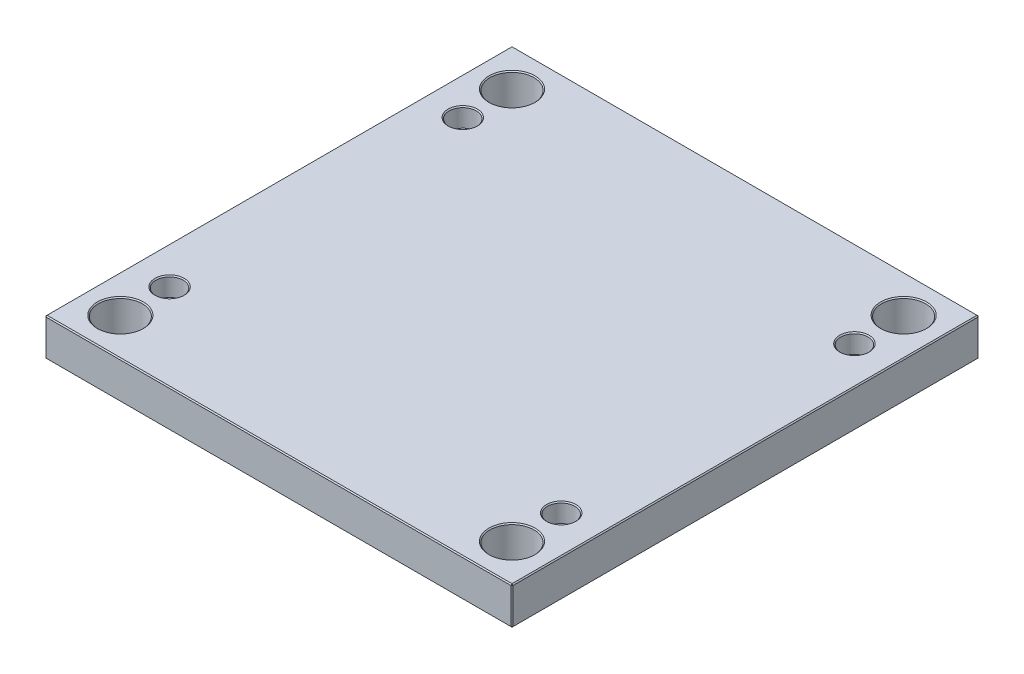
ISO-10303-21;
HEADER;
FILE_DESCRIPTION(('STEP AP214'),'2;1');
FILE_NAME('part.step','',(''),(''),'','','');
FILE_SCHEMA(('AUTOMOTIVE_DESIGN { 1 0 10303 214 1 1 1 1 }'));
ENDSEC;
DATA;
#1=APPLICATION_CONTEXT('core data for automotive mechanical design processes');
#2=APPLICATION_PROTOCOL_DEFINITION('international standard','automotive_design',2000,#1);
#3=PRODUCT_CONTEXT('',#1,'mechanical');
#4=PRODUCT('Part','Part','',(#3));
#5=PRODUCT_RELATED_PRODUCT_CATEGORY('part','',(#4));
#6=PRODUCT_DEFINITION_FORMATION('','',#4);
#7=PRODUCT_DEFINITION_CONTEXT('part definition',#1,'design');
#8=PRODUCT_DEFINITION('design','',#6,#7);
#9=PRODUCT_DEFINITION_SHAPE('','',#8);
#10=(LENGTH_UNIT() NAMED_UNIT(*) SI_UNIT(.MILLI.,.METRE.));
#11=(NAMED_UNIT(*) PLANE_ANGLE_UNIT() SI_UNIT($,.RADIAN.));
#12=(NAMED_UNIT(*) SI_UNIT($,.STERADIAN.) SOLID_ANGLE_UNIT());
#13=UNCERTAINTY_MEASURE_WITH_UNIT(LENGTH_MEASURE(1.E-05),#10,'distance_accuracy_value','');
#14=(GEOMETRIC_REPRESENTATION_CONTEXT(3) GLOBAL_UNCERTAINTY_ASSIGNED_CONTEXT((#13)) GLOBAL_UNIT_ASSIGNED_CONTEXT((#10,
#11,#12)) REPRESENTATION_CONTEXT('',''));
#15=CARTESIAN_POINT('',(0.,0.,0.));
#16=DIRECTION('',(0.,0.,1.));
#17=DIRECTION('',(1.,0.,0.));
#18=AXIS2_PLACEMENT_3D('',#15,#16,#17);
#19=CARTESIAN_POINT('',(-223.,36.,223.));
#20=DIRECTION('',(1.,0.,0.));
#21=DIRECTION('',(0.,0.,-1.));
#22=AXIS2_PLACEMENT_3D('',#19,#20,#21);
#23=PLANE('',#22);
#24=DIRECTION('',(0.,-1.,0.));
#25=VECTOR('',#24,1.);
#26=CARTESIAN_POINT('',(-223.,36.,-222.));
#27=LINE('',#26,#25);
#28=CARTESIAN_POINT('',(-223.,35.,-222.));
#29=VERTEX_POINT('',#28);
#30=CARTESIAN_POINT('',(-223.,1.,-222.));
#31=VERTEX_POINT('',#30);
#32=EDGE_CURVE('E115',#29,#31,#27,.T.);
#33=ORIENTED_EDGE('',*,*,#32,.T.);
#34=DIRECTION('',(0.,0.,1.));
#35=VECTOR('',#34,1.);
#36=CARTESIAN_POINT('',(-223.,1.,223.));
#37=LINE('',#36,#35);
#38=CARTESIAN_POINT('',(-223.,1.,222.));
#39=VERTEX_POINT('',#38);
#40=EDGE_CURVE('E111',#31,#39,#37,.T.);
#41=ORIENTED_EDGE('',*,*,#40,.T.);
#42=DIRECTION('',(0.,1.,0.));
#43=VECTOR('',#42,1.);
#44=CARTESIAN_POINT('',(-223.,36.,222.));
#45=LINE('',#44,#43);
#46=CARTESIAN_POINT('',(-223.,35.,222.));
#47=VERTEX_POINT('',#46);
#48=EDGE_CURVE('E104',#39,#47,#45,.T.);
#49=ORIENTED_EDGE('',*,*,#48,.T.);
#50=DIRECTION('',(0.,0.,-1.));
#51=VECTOR('',#50,1.);
#52=CARTESIAN_POINT('',(-223.,35.,-223.));
#53=LINE('',#52,#51);
#54=EDGE_CURVE('E108',#47,#29,#53,.T.);
#55=ORIENTED_EDGE('',*,*,#54,.T.);
#56=EDGE_LOOP('',(#33,#41,#49,#55));
#57=FACE_BOUND('',#56,.T.);
#58=ADVANCED_FACE('F16',(#57),#23,.F.);
#59=CARTESIAN_POINT('',(223.,36.,223.));
#60=DIRECTION('',(0.,0.,-1.));
#61=DIRECTION('',(-1.,0.,0.));
#62=AXIS2_PLACEMENT_3D('',#59,#60,#61);
#63=PLANE('',#62);
#64=DIRECTION('',(-1.,0.,0.));
#65=VECTOR('',#64,1.);
#66=CARTESIAN_POINT('',(-223.,35.,223.));
#67=LINE('',#66,#65);
#68=CARTESIAN_POINT('',(222.,35.,223.));
#69=VERTEX_POINT('',#68);
#70=CARTESIAN_POINT('',(-222.,35.,223.));
#71=VERTEX_POINT('',#70);
#72=EDGE_CURVE('E170',#69,#71,#67,.T.);
#73=ORIENTED_EDGE('',*,*,#72,.T.);
#74=DIRECTION('',(0.,-1.,0.));
#75=VECTOR('',#74,1.);
#76=CARTESIAN_POINT('',(-222.,36.,223.));
#77=LINE('',#76,#75);
#78=CARTESIAN_POINT('',(-222.,1.,223.));
#79=VERTEX_POINT('',#78);
#80=EDGE_CURVE('E123',#71,#79,#77,.T.);
#81=ORIENTED_EDGE('',*,*,#80,.T.);
#82=DIRECTION('',(1.,0.,0.));
#83=VECTOR('',#82,1.);
#84=CARTESIAN_POINT('',(223.,1.,223.));
#85=LINE('',#84,#83);
#86=CARTESIAN_POINT('',(222.,1.,223.));
#87=VERTEX_POINT('',#86);
#88=EDGE_CURVE('E174',#79,#87,#85,.T.);
#89=ORIENTED_EDGE('',*,*,#88,.T.);
#90=DIRECTION('',(0.,1.,0.));
#91=VECTOR('',#90,1.);
#92=CARTESIAN_POINT('',(222.,36.,223.));
#93=LINE('',#92,#91);
#94=EDGE_CURVE('E172',#87,#69,#93,.T.);
#95=ORIENTED_EDGE('',*,*,#94,.T.);
#96=EDGE_LOOP('',(#73,#81,#89,#95));
#97=FACE_BOUND('',#96,.T.);
#98=ADVANCED_FACE('F413',(#97),#63,.F.);
#99=CARTESIAN_POINT('',(223.,36.,223.));
#100=DIRECTION('',(-1.,0.,0.));
#101=DIRECTION('',(0.,0.,1.));
#102=AXIS2_PLACEMENT_3D('',#99,#100,#101);
#103=PLANE('',#102);
#104=DIRECTION('',(0.,0.,-1.));
#105=VECTOR('',#104,1.);
#106=CARTESIAN_POINT('',(223.,1.,223.));
#107=LINE('',#106,#105);
#108=CARTESIAN_POINT('',(223.,1.,222.));
#109=VERTEX_POINT('',#108);
#110=CARTESIAN_POINT('',(223.,1.,-222.));
#111=VERTEX_POINT('',#110);
#112=EDGE_CURVE('E165',#109,#111,#107,.T.);
#113=ORIENTED_EDGE('',*,*,#112,.T.);
#114=DIRECTION('',(0.,1.,0.));
#115=VECTOR('',#114,1.);
#116=CARTESIAN_POINT('',(223.,36.,-222.));
#117=LINE('',#116,#115);
#118=CARTESIAN_POINT('',(223.,35.,-222.));
#119=VERTEX_POINT('',#118);
#120=EDGE_CURVE('E167',#111,#119,#117,.T.);
#121=ORIENTED_EDGE('',*,*,#120,.T.);
#122=DIRECTION('',(0.,0.,1.));
#123=VECTOR('',#122,1.);
#124=CARTESIAN_POINT('',(223.,35.,223.));
#125=LINE('',#124,#123);
#126=CARTESIAN_POINT('',(223.,35.,222.));
#127=VERTEX_POINT('',#126);
#128=EDGE_CURVE('E161',#119,#127,#125,.T.);
#129=ORIENTED_EDGE('',*,*,#128,.T.);
#130=DIRECTION('',(0.,-1.,0.));
#131=VECTOR('',#130,1.);
#132=CARTESIAN_POINT('',(223.,36.,222.));
#133=LINE('',#132,#131);
#134=EDGE_CURVE('E163',#127,#109,#133,.T.);
#135=ORIENTED_EDGE('',*,*,#134,.T.);
#136=EDGE_LOOP('',(#113,#121,#129,#135));
#137=FACE_BOUND('',#136,.T.);
#138=ADVANCED_FACE('F406',(#137),#103,.F.);
#139=CARTESIAN_POINT('',(223.,36.,-223.));
#140=DIRECTION('',(0.,0.,1.));
#141=DIRECTION('',(1.,0.,0.));
#142=AXIS2_PLACEMENT_3D('',#139,#140,#141);
#143=PLANE('',#142);
#144=DIRECTION('',(0.,-1.,0.));
#145=VECTOR('',#144,1.);
#146=CARTESIAN_POINT('',(222.,36.,-223.));
#147=LINE('',#146,#145);
#148=CARTESIAN_POINT('',(222.,35.,-223.));
#149=VERTEX_POINT('',#148);
#150=CARTESIAN_POINT('',(222.,1.,-223.));
#151=VERTEX_POINT('',#150);
#152=EDGE_CURVE('E154',#149,#151,#147,.T.);
#153=ORIENTED_EDGE('',*,*,#152,.T.);
#154=DIRECTION('',(-1.,0.,0.));
#155=VECTOR('',#154,1.);
#156=CARTESIAN_POINT('',(223.,1.,-223.));
#157=LINE('',#156,#155);
#158=CARTESIAN_POINT('',(-222.,1.,-223.));
#159=VERTEX_POINT('',#158);
#160=EDGE_CURVE('E159',#151,#159,#157,.T.);
#161=ORIENTED_EDGE('',*,*,#160,.T.);
#162=DIRECTION('',(0.,1.,0.));
#163=VECTOR('',#162,1.);
#164=CARTESIAN_POINT('',(-222.,36.,-223.));
#165=LINE('',#164,#163);
#166=CARTESIAN_POINT('',(-222.,35.,-223.));
#167=VERTEX_POINT('',#166);
#168=EDGE_CURVE('E156',#159,#167,#165,.T.);
#169=ORIENTED_EDGE('',*,*,#168,.T.);
#170=DIRECTION('',(1.,0.,0.));
#171=VECTOR('',#170,1.);
#172=CARTESIAN_POINT('',(223.,35.,-223.));
#173=LINE('',#172,#171);
#174=EDGE_CURVE('E152',#167,#149,#173,.T.);
#175=ORIENTED_EDGE('',*,*,#174,.T.);
#176=EDGE_LOOP('',(#153,#161,#169,#175));
#177=FACE_BOUND('',#176,.T.);
#178=ADVANCED_FACE('F431',(#177),#143,.F.);
#179=CARTESIAN_POINT('',(0.,36.,0.));
#180=DIRECTION('',(0.,1.,0.));
#181=DIRECTION('',(0.,0.,1.));
#182=AXIS2_PLACEMENT_3D('',#179,#180,#181);
#183=PLANE('',#182);
#184=CARTESIAN_POINT('',(-187.,36.,187.));
#185=DIRECTION('',(0.,1.,0.));
#186=DIRECTION('',(0.,0.,1.));
#187=AXIS2_PLACEMENT_3D('',#184,#185,#186);
#188=CIRCLE('',#187,22.);
#189=CARTESIAN_POINT('',(-187.,36.,209.));
#190=VERTEX_POINT('',#189);
#191=EDGE_CURVE('E317',#190,#190,#188,.F.);
#192=ORIENTED_EDGE('',*,*,#191,.T.);
#193=EDGE_LOOP('',(#192));
#194=FACE_BOUND('',#193,.T.);
#195=CARTESIAN_POINT('',(187.,36.,187.));
#196=DIRECTION('',(0.,1.,0.));
#197=DIRECTION('',(0.,0.,1.));
#198=AXIS2_PLACEMENT_3D('',#195,#196,#197);
#199=CIRCLE('',#198,22.);
#200=CARTESIAN_POINT('',(187.,36.,209.));
#201=VERTEX_POINT('',#200);
#202=EDGE_CURVE('E314',#201,#201,#199,.F.);
#203=ORIENTED_EDGE('',*,*,#202,.T.);
#204=EDGE_LOOP('',(#203));
#205=FACE_BOUND('',#204,.T.);
#206=CARTESIAN_POINT('',(187.,36.,-187.));
#207=DIRECTION('',(0.,1.,0.));
#208=DIRECTION('',(0.,0.,1.));
#209=AXIS2_PLACEMENT_3D('',#206,#207,#208);
#210=CIRCLE('',#209,22.);
#211=CARTESIAN_POINT('',(187.,36.,-165.));
#212=VERTEX_POINT('',#211);
#213=EDGE_CURVE('E311',#212,#212,#210,.F.);
#214=ORIENTED_EDGE('',*,*,#213,.T.);
#215=EDGE_LOOP('',(#214));
#216=FACE_BOUND('',#215,.T.);
#217=CARTESIAN_POINT('',(-187.,36.,-187.));
#218=DIRECTION('',(0.,1.,0.));
#219=DIRECTION('',(0.,0.,1.));
#220=AXIS2_PLACEMENT_3D('',#217,#218,#219);
#221=CIRCLE('',#220,22.);
#222=CARTESIAN_POINT('',(-187.,36.,-165.));
#223=VERTEX_POINT('',#222);
#224=EDGE_CURVE('E308',#223,#223,#221,.F.);
#225=ORIENTED_EDGE('',*,*,#224,.T.);
#226=EDGE_LOOP('',(#225));
#227=FACE_BOUND('',#226,.T.);
#228=CARTESIAN_POINT('',(-187.,36.,140.));
#229=DIRECTION('',(0.,1.,0.));
#230=DIRECTION('',(0.,0.,1.));
#231=AXIS2_PLACEMENT_3D('',#228,#229,#230);
#232=CIRCLE('',#231,14.);
#233=CARTESIAN_POINT('',(-187.,36.,154.));
#234=VERTEX_POINT('',#233);
#235=EDGE_CURVE('E290',#234,#234,#232,.F.);
#236=ORIENTED_EDGE('',*,*,#235,.T.);
#237=EDGE_LOOP('',(#236));
#238=FACE_BOUND('',#237,.T.);
#239=CARTESIAN_POINT('',(187.,36.,140.));
#240=DIRECTION('',(0.,1.,0.));
#241=DIRECTION('',(0.,0.,1.));
#242=AXIS2_PLACEMENT_3D('',#239,#240,#241);
#243=CIRCLE('',#242,14.);
#244=CARTESIAN_POINT('',(187.,36.,154.));
#245=VERTEX_POINT('',#244);
#246=EDGE_CURVE('E287',#245,#245,#243,.F.);
#247=ORIENTED_EDGE('',*,*,#246,.T.);
#248=EDGE_LOOP('',(#247));
#249=FACE_BOUND('',#248,.T.);
#250=CARTESIAN_POINT('',(187.,36.,-140.));
#251=DIRECTION('',(0.,1.,0.));
#252=DIRECTION('',(0.,0.,1.));
#253=AXIS2_PLACEMENT_3D('',#250,#251,#252);
#254=CIRCLE('',#253,14.);
#255=CARTESIAN_POINT('',(187.,36.,-126.));
#256=VERTEX_POINT('',#255);
#257=EDGE_CURVE('E284',#256,#256,#254,.F.);
#258=ORIENTED_EDGE('',*,*,#257,.T.);
#259=EDGE_LOOP('',(#258));
#260=FACE_BOUND('',#259,.T.);
#261=CARTESIAN_POINT('',(-187.,36.,-140.));
#262=DIRECTION('',(0.,1.,0.));
#263=DIRECTION('',(0.,0.,1.));
#264=AXIS2_PLACEMENT_3D('',#261,#262,#263);
#265=CIRCLE('',#264,14.);
#266=CARTESIAN_POINT('',(-187.,36.,-126.));
#267=VERTEX_POINT('',#266);
#268=EDGE_CURVE('E281',#267,#267,#265,.F.);
#269=ORIENTED_EDGE('',*,*,#268,.T.);
#270=EDGE_LOOP('',(#269));
#271=FACE_BOUND('',#270,.T.);
#272=DIRECTION('',(0.,0.,-1.));
#273=VECTOR('',#272,1.);
#274=CARTESIAN_POINT('',(222.,36.,-223.));
#275=LINE('',#274,#273);
#276=CARTESIAN_POINT('',(222.,36.,222.));
#277=VERTEX_POINT('',#276);
#278=CARTESIAN_POINT('',(222.,36.,-222.));
#279=VERTEX_POINT('',#278);
#280=EDGE_CURVE('E31',#277,#279,#275,.T.);
#281=ORIENTED_EDGE('',*,*,#280,.T.);
#282=DIRECTION('',(-1.,0.,0.));
#283=VECTOR('',#282,1.);
#284=CARTESIAN_POINT('',(-223.,36.,-222.));
#285=LINE('',#284,#283);
#286=CARTESIAN_POINT('',(-222.,36.,-222.));
#287=VERTEX_POINT('',#286);
#288=EDGE_CURVE('E190',#279,#287,#285,.T.);
#289=ORIENTED_EDGE('',*,*,#288,.T.);
#290=DIRECTION('',(0.,0.,1.));
#291=VECTOR('',#290,1.);
#292=CARTESIAN_POINT('',(-222.,36.,223.));
#293=LINE('',#292,#291);
#294=CARTESIAN_POINT('',(-222.,36.,222.));
#295=VERTEX_POINT('',#294);
#296=EDGE_CURVE('E186',#287,#295,#293,.T.);
#297=ORIENTED_EDGE('',*,*,#296,.T.);
#298=DIRECTION('',(1.,0.,0.));
#299=VECTOR('',#298,1.);
#300=CARTESIAN_POINT('',(223.,36.,222.));
#301=LINE('',#300,#299);
#302=EDGE_CURVE('E36',#295,#277,#301,.T.);
#303=ORIENTED_EDGE('',*,*,#302,.T.);
#304=EDGE_LOOP('',(#281,#289,#297,#303));
#305=FACE_BOUND('',#304,.T.);
#306=ADVANCED_FACE('F357',(#194,#205,#216,#227,#238,#249,#260,#271,#305),#183,.T.);
#307=CARTESIAN_POINT('',(0.,0.,0.));
#308=DIRECTION('',(0.,1.,0.));
#309=DIRECTION('',(0.,0.,1.));
#310=AXIS2_PLACEMENT_3D('',#307,#308,#309);
#311=PLANE('',#310);
#312=CARTESIAN_POINT('',(-187.,0.,187.));
#313=DIRECTION('',(0.,1.,0.));
#314=DIRECTION('',(0.,0.,1.));
#315=AXIS2_PLACEMENT_3D('',#312,#313,#314);
#316=CIRCLE('',#315,22.);
#317=CARTESIAN_POINT('',(-187.,0.,209.));
#318=VERTEX_POINT('',#317);
#319=EDGE_CURVE('E329',#318,#318,#316,.T.);
#320=ORIENTED_EDGE('',*,*,#319,.T.);
#321=EDGE_LOOP('',(#320));
#322=FACE_BOUND('',#321,.T.);
#323=CARTESIAN_POINT('',(187.,0.,187.));
#324=DIRECTION('',(0.,1.,0.));
#325=DIRECTION('',(0.,0.,1.));
#326=AXIS2_PLACEMENT_3D('',#323,#324,#325);
#327=CIRCLE('',#326,22.);
#328=CARTESIAN_POINT('',(187.,0.,209.));
#329=VERTEX_POINT('',#328);
#330=EDGE_CURVE('E326',#329,#329,#327,.T.);
#331=ORIENTED_EDGE('',*,*,#330,.T.);
#332=EDGE_LOOP('',(#331));
#333=FACE_BOUND('',#332,.T.);
#334=CARTESIAN_POINT('',(187.,0.,-187.));
#335=DIRECTION('',(0.,1.,0.));
#336=DIRECTION('',(0.,0.,1.));
#337=AXIS2_PLACEMENT_3D('',#334,#335,#336);
#338=CIRCLE('',#337,22.);
#339=CARTESIAN_POINT('',(187.,0.,-165.));
#340=VERTEX_POINT('',#339);
#341=EDGE_CURVE('E323',#340,#340,#338,.T.);
#342=ORIENTED_EDGE('',*,*,#341,.T.);
#343=EDGE_LOOP('',(#342));
#344=FACE_BOUND('',#343,.T.);
#345=CARTESIAN_POINT('',(-187.,0.,-187.));
#346=DIRECTION('',(0.,1.,0.));
#347=DIRECTION('',(0.,0.,1.));
#348=AXIS2_PLACEMENT_3D('',#345,#346,#347);
#349=CIRCLE('',#348,22.);
#350=CARTESIAN_POINT('',(-187.,0.,-165.));
#351=VERTEX_POINT('',#350);
#352=EDGE_CURVE('E320',#351,#351,#349,.T.);
#353=ORIENTED_EDGE('',*,*,#352,.T.);
#354=EDGE_LOOP('',(#353));
#355=FACE_BOUND('',#354,.T.);
#356=CARTESIAN_POINT('',(187.,0.,-140.));
#357=DIRECTION('',(0.,1.,0.));
#358=DIRECTION('',(0.,0.,1.));
#359=AXIS2_PLACEMENT_3D('',#356,#357,#358);
#360=CIRCLE('',#359,10.0000000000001);
#361=CARTESIAN_POINT('',(187.,0.,-130.));
#362=VERTEX_POINT('',#361);
#363=EDGE_CURVE('E263',#362,#362,#360,.T.);
#364=ORIENTED_EDGE('',*,*,#363,.T.);
#365=EDGE_LOOP('',(#364));
#366=FACE_BOUND('',#365,.T.);
#367=CARTESIAN_POINT('',(187.,0.,140.));
#368=DIRECTION('',(0.,1.,0.));
#369=DIRECTION('',(0.,0.,1.));
#370=AXIS2_PLACEMENT_3D('',#367,#368,#369);
#371=CIRCLE('',#370,10.0000000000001);
#372=CARTESIAN_POINT('',(187.,0.,150.));
#373=VERTEX_POINT('',#372);
#374=EDGE_CURVE('E260',#373,#373,#371,.T.);
#375=ORIENTED_EDGE('',*,*,#374,.T.);
#376=EDGE_LOOP('',(#375));
#377=FACE_BOUND('',#376,.T.);
#378=CARTESIAN_POINT('',(-187.,0.,140.));
#379=DIRECTION('',(0.,1.,0.));
#380=DIRECTION('',(0.,0.,1.));
#381=AXIS2_PLACEMENT_3D('',#378,#379,#380);
#382=CIRCLE('',#381,10.0000000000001);
#383=CARTESIAN_POINT('',(-187.,0.,150.));
#384=VERTEX_POINT('',#383);
#385=EDGE_CURVE('E257',#384,#384,#382,.T.);
#386=ORIENTED_EDGE('',*,*,#385,.T.);
#387=EDGE_LOOP('',(#386));
#388=FACE_BOUND('',#387,.T.);
#389=CARTESIAN_POINT('',(-187.,0.,-140.));
#390=DIRECTION('',(0.,1.,0.));
#391=DIRECTION('',(0.,0.,1.));
#392=AXIS2_PLACEMENT_3D('',#389,#390,#391);
#393=CIRCLE('',#392,10.0000000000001);
#394=CARTESIAN_POINT('',(-187.,0.,-130.));
#395=VERTEX_POINT('',#394);
#396=EDGE_CURVE('E192',#395,#395,#393,.T.);
#397=ORIENTED_EDGE('',*,*,#396,.T.);
#398=EDGE_LOOP('',(#397));
#399=FACE_BOUND('',#398,.T.);
#400=DIRECTION('',(0.,0.,1.));
#401=VECTOR('',#400,1.);
#402=CARTESIAN_POINT('',(222.,0.,0.));
#403=LINE('',#402,#401);
#404=CARTESIAN_POINT('',(222.,0.,-222.));
#405=VERTEX_POINT('',#404);
#406=CARTESIAN_POINT('',(222.,0.,222.));
#407=VERTEX_POINT('',#406);
#408=EDGE_CURVE('E177',#405,#407,#403,.T.);
#409=ORIENTED_EDGE('',*,*,#408,.T.);
#410=DIRECTION('',(-1.,0.,0.));
#411=VECTOR('',#410,1.);
#412=CARTESIAN_POINT('',(0.,0.,222.));
#413=LINE('',#412,#411);
#414=CARTESIAN_POINT('',(-222.,0.,222.));
#415=VERTEX_POINT('',#414);
#416=EDGE_CURVE('E183',#407,#415,#413,.T.);
#417=ORIENTED_EDGE('',*,*,#416,.T.);
#418=DIRECTION('',(0.,0.,-1.));
#419=VECTOR('',#418,1.);
#420=CARTESIAN_POINT('',(-222.,0.,0.));
#421=LINE('',#420,#419);
#422=CARTESIAN_POINT('',(-222.,0.,-222.));
#423=VERTEX_POINT('',#422);
#424=EDGE_CURVE('E181',#415,#423,#421,.T.);
#425=ORIENTED_EDGE('',*,*,#424,.T.);
#426=DIRECTION('',(1.,0.,0.));
#427=VECTOR('',#426,1.);
#428=CARTESIAN_POINT('',(0.,0.,-222.));
#429=LINE('',#428,#427);
#430=EDGE_CURVE('E179',#423,#405,#429,.T.);
#431=ORIENTED_EDGE('',*,*,#430,.T.);
#432=EDGE_LOOP('',(#409,#417,#425,#431));
#433=FACE_BOUND('',#432,.T.);
#434=ADVANCED_FACE('F353',(#322,#333,#344,#355,#366,#377,#388,#399,#433),#311,.F.);
#435=CARTESIAN_POINT('',(223.,36.,222.));
#436=DIRECTION('',(-0.707106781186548,0.,-0.707106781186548));
#437=DIRECTION('',(0.,-1.,0.));
#438=AXIS2_PLACEMENT_3D('',#435,#436,#437);
#439=PLANE('',#438);
#440=DIRECTION('',(-0.707106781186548,0.,0.707106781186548));
#441=VECTOR('',#440,1.);
#442=CARTESIAN_POINT('',(222.,35.,223.));
#443=LINE('',#442,#441);
#444=EDGE_CURVE('E141',#69,#127,#443,.F.);
#445=ORIENTED_EDGE('',*,*,#444,.F.);
#446=ORIENTED_EDGE('',*,*,#94,.F.);
#447=DIRECTION('',(0.707106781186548,0.,-0.707106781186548));
#448=VECTOR('',#447,1.);
#449=CARTESIAN_POINT('',(222.,1.,223.));
#450=LINE('',#449,#448);
#451=EDGE_CURVE('E144',#109,#87,#450,.F.);
#452=ORIENTED_EDGE('',*,*,#451,.F.);
#453=ORIENTED_EDGE('',*,*,#134,.F.);
#454=EDGE_LOOP('',(#445,#446,#452,#453));
#455=FACE_BOUND('',#454,.T.);
#456=ADVANCED_FACE('F356',(#455),#439,.F.);
#457=CARTESIAN_POINT('',(222.,35.,223.));
#458=DIRECTION('',(0.577350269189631,0.577350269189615,0.577350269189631));
#459=DIRECTION('',(0.707106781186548,0.,-0.707106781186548));
#460=AXIS2_PLACEMENT_3D('',#457,#458,#459);
#461=PLANE('',#460);
#462=DIRECTION('',(0.,-0.707106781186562,0.707106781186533));
#463=VECTOR('',#462,1.);
#464=CARTESIAN_POINT('',(222.,35.,223.));
#465=LINE('',#464,#463);
#466=EDGE_CURVE('E235',#69,#277,#465,.F.);
#467=ORIENTED_EDGE('',*,*,#466,.F.);
#468=ORIENTED_EDGE('',*,*,#444,.T.);
#469=DIRECTION('',(-0.707106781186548,0.707106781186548,0.));
#470=VECTOR('',#469,1.);
#471=CARTESIAN_POINT('',(222.5,35.5,222.));
#472=LINE('',#471,#470);
#473=EDGE_CURVE('E237',#277,#127,#472,.F.);
#474=ORIENTED_EDGE('',*,*,#473,.F.);
#475=EDGE_LOOP('',(#467,#468,#474));
#476=FACE_BOUND('',#475,.T.);
#477=ADVANCED_FACE('F419',(#476),#461,.T.);
#478=CARTESIAN_POINT('',(222.,1.,223.));
#479=DIRECTION('',(0.577350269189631,-0.577350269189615,0.577350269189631));
#480=DIRECTION('',(0.707106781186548,0.,-0.707106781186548));
#481=AXIS2_PLACEMENT_3D('',#478,#479,#480);
#482=PLANE('',#481);
#483=DIRECTION('',(-0.707106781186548,-0.707106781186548,0.));
#484=VECTOR('',#483,1.);
#485=CARTESIAN_POINT('',(222.5,0.499999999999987,222.));
#486=LINE('',#485,#484);
#487=EDGE_CURVE('E229',#109,#407,#486,.T.);
#488=ORIENTED_EDGE('',*,*,#487,.F.);
#489=ORIENTED_EDGE('',*,*,#451,.T.);
#490=DIRECTION('',(0.,0.707106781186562,0.707106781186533));
#491=VECTOR('',#490,1.);
#492=CARTESIAN_POINT('',(222.,1.,223.));
#493=LINE('',#492,#491);
#494=EDGE_CURVE('E232',#407,#87,#493,.T.);
#495=ORIENTED_EDGE('',*,*,#494,.F.);
#496=EDGE_LOOP('',(#488,#489,#495));
#497=FACE_BOUND('',#496,.T.);
#498=ADVANCED_FACE('F378',(#497),#482,.T.);
#499=CARTESIAN_POINT('',(222.,36.,0.));
#500=DIRECTION('',(0.707106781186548,0.707106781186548,0.));
#501=DIRECTION('',(0.,0.,1.));
#502=AXIS2_PLACEMENT_3D('',#499,#500,#501);
#503=PLANE('',#502);
#504=ORIENTED_EDGE('',*,*,#473,.T.);
#505=ORIENTED_EDGE('',*,*,#128,.F.);
#506=DIRECTION('',(0.707106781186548,-0.707106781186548,0.));
#507=VECTOR('',#506,1.);
#508=CARTESIAN_POINT('',(223.,35.,-222.));
#509=LINE('',#508,#507);
#510=EDGE_CURVE('E224',#279,#119,#509,.T.);
#511=ORIENTED_EDGE('',*,*,#510,.F.);
#512=ORIENTED_EDGE('',*,*,#280,.F.);
#513=EDGE_LOOP('',(#504,#505,#511,#512));
#514=FACE_BOUND('',#513,.T.);
#515=ADVANCED_FACE('F421',(#514),#503,.T.);
#516=CARTESIAN_POINT('',(0.,36.,222.));
#517=DIRECTION('',(0.,0.707106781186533,0.707106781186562));
#518=DIRECTION('',(-1.,0.,0.));
#519=AXIS2_PLACEMENT_3D('',#516,#517,#518);
#520=PLANE('',#519);
#521=ORIENTED_EDGE('',*,*,#466,.T.);
#522=ORIENTED_EDGE('',*,*,#302,.F.);
#523=DIRECTION('',(0.,0.707106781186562,-0.707106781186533));
#524=VECTOR('',#523,1.);
#525=CARTESIAN_POINT('',(-222.,35.5,222.5));
#526=LINE('',#525,#524);
#527=EDGE_CURVE('E127',#71,#295,#526,.T.);
#528=ORIENTED_EDGE('',*,*,#527,.F.);
#529=ORIENTED_EDGE('',*,*,#72,.F.);
#530=EDGE_LOOP('',(#521,#522,#528,#529));
#531=FACE_BOUND('',#530,.T.);
#532=ADVANCED_FACE('F416',(#531),#520,.T.);
#533=CARTESIAN_POINT('',(-222.,36.,223.));
#534=DIRECTION('',(0.707106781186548,0.,-0.707106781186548));
#535=DIRECTION('',(0.,-1.,0.));
#536=AXIS2_PLACEMENT_3D('',#533,#534,#535);
#537=PLANE('',#536);
#538=DIRECTION('',(0.707106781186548,0.,0.707106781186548));
#539=VECTOR('',#538,1.);
#540=CARTESIAN_POINT('',(-222.,1.,223.));
#541=LINE('',#540,#539);
#542=EDGE_CURVE('E128',#79,#39,#541,.F.);
#543=ORIENTED_EDGE('',*,*,#542,.F.);
#544=ORIENTED_EDGE('',*,*,#80,.F.);
#545=DIRECTION('',(-0.707106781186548,0.,-0.707106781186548));
#546=VECTOR('',#545,1.);
#547=CARTESIAN_POINT('',(-223.,35.,222.));
#548=LINE('',#547,#546);
#549=EDGE_CURVE('E119',#47,#71,#548,.F.);
#550=ORIENTED_EDGE('',*,*,#549,.F.);
#551=ORIENTED_EDGE('',*,*,#48,.F.);
#552=EDGE_LOOP('',(#543,#544,#550,#551));
#553=FACE_BOUND('',#552,.T.);
#554=ADVANCED_FACE('F121',(#553),#537,.F.);
#555=CARTESIAN_POINT('',(223.,1.,223.));
#556=DIRECTION('',(0.,0.707106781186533,-0.707106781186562));
#557=DIRECTION('',(1.,0.,0.));
#558=AXIS2_PLACEMENT_3D('',#555,#556,#557);
#559=PLANE('',#558);
#560=ORIENTED_EDGE('',*,*,#494,.T.);
#561=ORIENTED_EDGE('',*,*,#88,.F.);
#562=DIRECTION('',(0.,-0.707106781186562,-0.707106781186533));
#563=VECTOR('',#562,1.);
#564=CARTESIAN_POINT('',(-222.,1.,223.));
#565=LINE('',#564,#563);
#566=EDGE_CURVE('E220',#415,#79,#565,.F.);
#567=ORIENTED_EDGE('',*,*,#566,.F.);
#568=ORIENTED_EDGE('',*,*,#416,.F.);
#569=EDGE_LOOP('',(#560,#561,#567,#568));
#570=FACE_BOUND('',#569,.T.);
#571=ADVANCED_FACE('F383',(#570),#559,.F.);
#572=CARTESIAN_POINT('',(223.,1.,223.));
#573=DIRECTION('',(-0.707106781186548,0.707106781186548,0.));
#574=DIRECTION('',(0.,0.,-1.));
#575=AXIS2_PLACEMENT_3D('',#572,#573,#574);
#576=PLANE('',#575);
#577=ORIENTED_EDGE('',*,*,#487,.T.);
#578=ORIENTED_EDGE('',*,*,#408,.F.);
#579=DIRECTION('',(0.707106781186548,0.707106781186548,0.));
#580=VECTOR('',#579,1.);
#581=CARTESIAN_POINT('',(222.5,0.499999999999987,-222.));
#582=LINE('',#581,#580);
#583=EDGE_CURVE('E217',#111,#405,#582,.F.);
#584=ORIENTED_EDGE('',*,*,#583,.F.);
#585=ORIENTED_EDGE('',*,*,#112,.F.);
#586=EDGE_LOOP('',(#577,#578,#584,#585));
#587=FACE_BOUND('',#586,.T.);
#588=ADVANCED_FACE('F376',(#587),#576,.F.);
#589=CARTESIAN_POINT('',(222.,36.,-223.));
#590=DIRECTION('',(-0.707106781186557,0.,0.707106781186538));
#591=DIRECTION('',(0.,-1.,0.));
#592=AXIS2_PLACEMENT_3D('',#589,#590,#591);
#593=PLANE('',#592);
#594=DIRECTION('',(0.707106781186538,0.,0.707106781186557));
#595=VECTOR('',#594,1.);
#596=CARTESIAN_POINT('',(223.,35.,-222.));
#597=LINE('',#596,#595);
#598=EDGE_CURVE('E226',#119,#149,#597,.F.);
#599=ORIENTED_EDGE('',*,*,#598,.F.);
#600=ORIENTED_EDGE('',*,*,#120,.F.);
#601=DIRECTION('',(-0.707106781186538,0.,-0.707106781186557));
#602=VECTOR('',#601,1.);
#603=CARTESIAN_POINT('',(222.,1.,-223.));
#604=LINE('',#603,#602);
#605=EDGE_CURVE('E214',#151,#111,#604,.F.);
#606=ORIENTED_EDGE('',*,*,#605,.F.);
#607=ORIENTED_EDGE('',*,*,#152,.F.);
#608=EDGE_LOOP('',(#599,#600,#606,#607));
#609=FACE_BOUND('',#608,.T.);
#610=ADVANCED_FACE('F403',(#609),#593,.F.);
#611=CARTESIAN_POINT('',(223.,35.,-222.));
#612=DIRECTION('',(0.577350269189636,0.57735026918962,-0.57735026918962));
#613=DIRECTION('',(-0.707106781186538,0.,-0.707106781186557));
#614=AXIS2_PLACEMENT_3D('',#611,#612,#613);
#615=PLANE('',#614);
#616=ORIENTED_EDGE('',*,*,#510,.T.);
#617=ORIENTED_EDGE('',*,*,#598,.T.);
#618=DIRECTION('',(0.,0.707106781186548,0.707106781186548));
#619=VECTOR('',#618,1.);
#620=CARTESIAN_POINT('',(222.,35.5,-222.5));
#621=LINE('',#620,#619);
#622=EDGE_CURVE('E135',#279,#149,#621,.F.);
#623=ORIENTED_EDGE('',*,*,#622,.F.);
#624=EDGE_LOOP('',(#616,#617,#623));
#625=FACE_BOUND('',#624,.T.);
#626=ADVANCED_FACE('F425',(#625),#615,.T.);
#627=CARTESIAN_POINT('',(-223.,35.,222.));
#628=DIRECTION('',(-0.577350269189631,0.577350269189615,0.577350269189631));
#629=DIRECTION('',(0.707106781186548,0.,0.707106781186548));
#630=AXIS2_PLACEMENT_3D('',#627,#628,#629);
#631=PLANE('',#630);
#632=ORIENTED_EDGE('',*,*,#549,.T.);
#633=ORIENTED_EDGE('',*,*,#527,.T.);
#634=DIRECTION('',(-0.707106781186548,-0.707106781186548,0.));
#635=VECTOR('',#634,1.);
#636=CARTESIAN_POINT('',(-223.,35.,222.));
#637=LINE('',#636,#635);
#638=EDGE_CURVE('E131',#47,#295,#637,.F.);
#639=ORIENTED_EDGE('',*,*,#638,.F.);
#640=EDGE_LOOP('',(#632,#633,#639));
#641=FACE_BOUND('',#640,.T.);
#642=ADVANCED_FACE('F132',(#641),#631,.T.);
#643=CARTESIAN_POINT('',(-222.,1.,223.));
#644=DIRECTION('',(-0.577350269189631,-0.577350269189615,0.577350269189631));
#645=DIRECTION('',(0.707106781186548,0.,0.707106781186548));
#646=AXIS2_PLACEMENT_3D('',#643,#644,#645);
#647=PLANE('',#646);
#648=ORIENTED_EDGE('',*,*,#566,.T.);
#649=ORIENTED_EDGE('',*,*,#542,.T.);
#650=DIRECTION('',(-0.707106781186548,0.707106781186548,0.));
#651=VECTOR('',#650,1.);
#652=CARTESIAN_POINT('',(-222.5,0.499999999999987,222.));
#653=LINE('',#652,#651);
#654=EDGE_CURVE('E136',#415,#39,#653,.T.);
#655=ORIENTED_EDGE('',*,*,#654,.F.);
#656=EDGE_LOOP('',(#648,#649,#655));
#657=FACE_BOUND('',#656,.T.);
#658=ADVANCED_FACE('F386',(#657),#647,.T.);
#659=CARTESIAN_POINT('',(222.,1.,-223.));
#660=DIRECTION('',(0.577350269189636,-0.57735026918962,-0.57735026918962));
#661=DIRECTION('',(-0.707106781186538,0.,-0.707106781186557));
#662=AXIS2_PLACEMENT_3D('',#659,#660,#661);
#663=PLANE('',#662);
#664=ORIENTED_EDGE('',*,*,#605,.T.);
#665=ORIENTED_EDGE('',*,*,#583,.T.);
#666=DIRECTION('',(0.,-0.707106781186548,0.707106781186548));
#667=VECTOR('',#666,1.);
#668=CARTESIAN_POINT('',(222.,1.,-223.));
#669=LINE('',#668,#667);
#670=EDGE_CURVE('E207',#151,#405,#669,.T.);
#671=ORIENTED_EDGE('',*,*,#670,.F.);
#672=EDGE_LOOP('',(#664,#665,#671));
#673=FACE_BOUND('',#672,.T.);
#674=ADVANCED_FACE('F397',(#673),#663,.T.);
#675=CARTESIAN_POINT('',(0.,36.,-222.));
#676=DIRECTION('',(0.,0.707106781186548,-0.707106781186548));
#677=DIRECTION('',(1.,0.,0.));
#678=AXIS2_PLACEMENT_3D('',#675,#676,#677);
#679=PLANE('',#678);
#680=ORIENTED_EDGE('',*,*,#622,.T.);
#681=ORIENTED_EDGE('',*,*,#174,.F.);
#682=DIRECTION('',(0.,-0.707106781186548,-0.707106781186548));
#683=VECTOR('',#682,1.);
#684=CARTESIAN_POINT('',(-222.,35.,-223.));
#685=LINE('',#684,#683);
#686=EDGE_CURVE('E204',#287,#167,#685,.T.);
#687=ORIENTED_EDGE('',*,*,#686,.F.);
#688=ORIENTED_EDGE('',*,*,#288,.F.);
#689=EDGE_LOOP('',(#680,#681,#687,#688));
#690=FACE_BOUND('',#689,.T.);
#691=ADVANCED_FACE('F429',(#690),#679,.T.);
#692=CARTESIAN_POINT('',(-222.,36.,0.));
#693=DIRECTION('',(-0.707106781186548,0.707106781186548,0.));
#694=DIRECTION('',(0.,0.,-1.));
#695=AXIS2_PLACEMENT_3D('',#692,#693,#694);
#696=PLANE('',#695);
#697=ORIENTED_EDGE('',*,*,#638,.T.);
#698=ORIENTED_EDGE('',*,*,#296,.F.);
#699=DIRECTION('',(0.707106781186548,0.707106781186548,0.));
#700=VECTOR('',#699,1.);
#701=CARTESIAN_POINT('',(-222.5,35.5,-222.));
#702=LINE('',#701,#700);
#703=EDGE_CURVE('E139',#29,#287,#702,.T.);
#704=ORIENTED_EDGE('',*,*,#703,.F.);
#705=ORIENTED_EDGE('',*,*,#54,.F.);
#706=EDGE_LOOP('',(#697,#698,#704,#705));
#707=FACE_BOUND('',#706,.T.);
#708=ADVANCED_FACE('F138',(#707),#696,.T.);
#709=CARTESIAN_POINT('',(-223.,1.,223.));
#710=DIRECTION('',(0.707106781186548,0.707106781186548,0.));
#711=DIRECTION('',(0.,0.,1.));
#712=AXIS2_PLACEMENT_3D('',#709,#710,#711);
#713=PLANE('',#712);
#714=ORIENTED_EDGE('',*,*,#654,.T.);
#715=ORIENTED_EDGE('',*,*,#40,.F.);
#716=DIRECTION('',(0.707106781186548,-0.707106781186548,0.));
#717=VECTOR('',#716,1.);
#718=CARTESIAN_POINT('',(-223.,1.,-222.));
#719=LINE('',#718,#717);
#720=EDGE_CURVE('E200',#423,#31,#719,.F.);
#721=ORIENTED_EDGE('',*,*,#720,.F.);
#722=ORIENTED_EDGE('',*,*,#424,.F.);
#723=EDGE_LOOP('',(#714,#715,#721,#722));
#724=FACE_BOUND('',#723,.T.);
#725=ADVANCED_FACE('F388',(#724),#713,.F.);
#726=CARTESIAN_POINT('',(223.,1.,-223.));
#727=DIRECTION('',(0.,0.707106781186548,0.707106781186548));
#728=DIRECTION('',(-1.,0.,0.));
#729=AXIS2_PLACEMENT_3D('',#726,#727,#728);
#730=PLANE('',#729);
#731=ORIENTED_EDGE('',*,*,#670,.T.);
#732=ORIENTED_EDGE('',*,*,#430,.F.);
#733=DIRECTION('',(0.,0.707106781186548,-0.707106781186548));
#734=VECTOR('',#733,1.);
#735=CARTESIAN_POINT('',(-222.,0.5,-222.5));
#736=LINE('',#735,#734);
#737=EDGE_CURVE('E197',#159,#423,#736,.F.);
#738=ORIENTED_EDGE('',*,*,#737,.F.);
#739=ORIENTED_EDGE('',*,*,#160,.F.);
#740=EDGE_LOOP('',(#731,#732,#738,#739));
#741=FACE_BOUND('',#740,.T.);
#742=ADVANCED_FACE('F392',(#741),#730,.F.);
#743=CARTESIAN_POINT('',(-222.,35.,-223.));
#744=DIRECTION('',(-0.577350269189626,0.577350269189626,-0.577350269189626));
#745=DIRECTION('',(-0.707106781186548,0.,0.707106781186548));
#746=AXIS2_PLACEMENT_3D('',#743,#744,#745);
#747=PLANE('',#746);
#748=ORIENTED_EDGE('',*,*,#703,.T.);
#749=ORIENTED_EDGE('',*,*,#686,.T.);
#750=DIRECTION('',(0.707106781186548,0.,-0.707106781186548));
#751=VECTOR('',#750,1.);
#752=CARTESIAN_POINT('',(-222.,35.,-223.));
#753=LINE('',#752,#751);
#754=EDGE_CURVE('E195',#29,#167,#753,.T.);
#755=ORIENTED_EDGE('',*,*,#754,.F.);
#756=EDGE_LOOP('',(#748,#749,#755));
#757=FACE_BOUND('',#756,.T.);
#758=ADVANCED_FACE('F460',(#757),#747,.T.);
#759=CARTESIAN_POINT('',(-223.,1.,-222.));
#760=DIRECTION('',(-0.577350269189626,-0.577350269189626,-0.577350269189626));
#761=DIRECTION('',(-0.707106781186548,0.,0.707106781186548));
#762=AXIS2_PLACEMENT_3D('',#759,#760,#761);
#763=PLANE('',#762);
#764=ORIENTED_EDGE('',*,*,#737,.T.);
#765=ORIENTED_EDGE('',*,*,#720,.T.);
#766=DIRECTION('',(-0.707106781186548,0.,0.707106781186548));
#767=VECTOR('',#766,1.);
#768=CARTESIAN_POINT('',(-223.,1.,-222.));
#769=LINE('',#768,#767);
#770=EDGE_CURVE('E193',#159,#31,#769,.T.);
#771=ORIENTED_EDGE('',*,*,#770,.F.);
#772=EDGE_LOOP('',(#764,#765,#771));
#773=FACE_BOUND('',#772,.T.);
#774=ADVANCED_FACE('F456',(#773),#763,.T.);
#775=CARTESIAN_POINT('',(-223.,36.,-222.));
#776=DIRECTION('',(0.707106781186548,0.,0.707106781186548));
#777=DIRECTION('',(0.,-1.,0.));
#778=AXIS2_PLACEMENT_3D('',#775,#776,#777);
#779=PLANE('',#778);
#780=ORIENTED_EDGE('',*,*,#754,.T.);
#781=ORIENTED_EDGE('',*,*,#168,.F.);
#782=ORIENTED_EDGE('',*,*,#770,.T.);
#783=ORIENTED_EDGE('',*,*,#32,.F.);
#784=EDGE_LOOP('',(#780,#781,#782,#783));
#785=FACE_BOUND('',#784,.T.);
#786=ADVANCED_FACE('F452',(#785),#779,.F.);
#787=CARTESIAN_POINT('',(-187.,18.,-140.));
#788=DIRECTION('',(0.,1.,0.));
#789=DIRECTION('',(0.,0.,1.));
#790=AXIS2_PLACEMENT_3D('',#787,#788,#789);
#791=CYLINDRICAL_SURFACE('',#790,13.);
#792=CARTESIAN_POINT('',(-187.,35.,-140.));
#793=DIRECTION('',(0.,1.,0.));
#794=DIRECTION('',(0.,0.,1.));
#795=AXIS2_PLACEMENT_3D('',#792,#793,#794);
#796=CIRCLE('',#795,13.);
#797=CARTESIAN_POINT('',(-187.,35.,-127.));
#798=VERTEX_POINT('',#797);
#799=EDGE_CURVE('E299',#798,#798,#796,.T.);
#800=ORIENTED_EDGE('',*,*,#799,.T.);
#801=EDGE_LOOP('',(#800));
#802=FACE_BOUND('',#801,.T.);
#803=CARTESIAN_POINT('',(-187.,18.,-140.));
#804=DIRECTION('',(0.,1.,0.));
#805=DIRECTION('',(0.,0.,1.));
#806=AXIS2_PLACEMENT_3D('',#803,#804,#805);
#807=CIRCLE('',#806,13.);
#808=CARTESIAN_POINT('',(-187.,18.,-127.));
#809=VERTEX_POINT('',#808);
#810=EDGE_CURVE('E147',#809,#809,#807,.T.);
#811=ORIENTED_EDGE('',*,*,#810,.F.);
#812=EDGE_LOOP('',(#811));
#813=FACE_BOUND('',#812,.T.);
#814=ADVANCED_FACE('F455',(#802,#813),#791,.F.);
#815=CARTESIAN_POINT('',(-187.,18.,-140.));
#816=DIRECTION('',(0.,1.,0.));
#817=DIRECTION('',(0.,0.,1.));
#818=AXIS2_PLACEMENT_3D('',#815,#816,#817);
#819=PLANE('',#818);
#820=CARTESIAN_POINT('',(-187.,18.,-140.));
#821=DIRECTION('',(0.,1.,0.));
#822=DIRECTION('',(0.,0.,1.));
#823=AXIS2_PLACEMENT_3D('',#820,#821,#822);
#824=CIRCLE('',#823,9.);
#825=CARTESIAN_POINT('',(-187.,18.,-131.));
#826=VERTEX_POINT('',#825);
#827=EDGE_CURVE('E251',#826,#826,#824,.T.);
#828=ORIENTED_EDGE('',*,*,#827,.F.);
#829=EDGE_LOOP('',(#828));
#830=FACE_BOUND('',#829,.T.);
#831=ORIENTED_EDGE('',*,*,#810,.T.);
#832=EDGE_LOOP('',(#831));
#833=FACE_BOUND('',#832,.T.);
#834=ADVANCED_FACE('F602',(#830,#833),#819,.T.);
#835=CARTESIAN_POINT('',(187.,18.,-140.));
#836=DIRECTION('',(0.,1.,0.));
#837=DIRECTION('',(0.,0.,1.));
#838=AXIS2_PLACEMENT_3D('',#835,#836,#837);
#839=CYLINDRICAL_SURFACE('',#838,13.);
#840=CARTESIAN_POINT('',(187.,35.,-140.));
#841=DIRECTION('',(0.,1.,0.));
#842=DIRECTION('',(0.,0.,1.));
#843=AXIS2_PLACEMENT_3D('',#840,#841,#842);
#844=CIRCLE('',#843,13.);
#845=CARTESIAN_POINT('',(187.,35.,-127.));
#846=VERTEX_POINT('',#845);
#847=EDGE_CURVE('E296',#846,#846,#844,.T.);
#848=ORIENTED_EDGE('',*,*,#847,.T.);
#849=EDGE_LOOP('',(#848));
#850=FACE_BOUND('',#849,.T.);
#851=CARTESIAN_POINT('',(187.,18.,-140.));
#852=DIRECTION('',(0.,1.,0.));
#853=DIRECTION('',(0.,0.,1.));
#854=AXIS2_PLACEMENT_3D('',#851,#852,#853);
#855=CIRCLE('',#854,13.);
#856=CARTESIAN_POINT('',(187.,18.,-127.));
#857=VERTEX_POINT('',#856);
#858=EDGE_CURVE('E630',#857,#857,#855,.T.);
#859=ORIENTED_EDGE('',*,*,#858,.F.);
#860=EDGE_LOOP('',(#859));
#861=FACE_BOUND('',#860,.T.);
#862=ADVANCED_FACE('F598',(#850,#861),#839,.F.);
#863=CARTESIAN_POINT('',(187.,18.,-140.));
#864=DIRECTION('',(0.,1.,0.));
#865=DIRECTION('',(0.,0.,1.));
#866=AXIS2_PLACEMENT_3D('',#863,#864,#865);
#867=PLANE('',#866);
#868=CARTESIAN_POINT('',(187.,18.,-140.));
#869=DIRECTION('',(0.,1.,0.));
#870=DIRECTION('',(0.,0.,1.));
#871=AXIS2_PLACEMENT_3D('',#868,#869,#870);
#872=CIRCLE('',#871,9.);
#873=CARTESIAN_POINT('',(187.,18.,-131.));
#874=VERTEX_POINT('',#873);
#875=EDGE_CURVE('E248',#874,#874,#872,.T.);
#876=ORIENTED_EDGE('',*,*,#875,.F.);
#877=EDGE_LOOP('',(#876));
#878=FACE_BOUND('',#877,.T.);
#879=ORIENTED_EDGE('',*,*,#858,.T.);
#880=EDGE_LOOP('',(#879));
#881=FACE_BOUND('',#880,.T.);
#882=ADVANCED_FACE('F594',(#878,#881),#867,.T.);
#883=CARTESIAN_POINT('',(187.,18.,140.));
#884=DIRECTION('',(0.,1.,0.));
#885=DIRECTION('',(0.,0.,1.));
#886=AXIS2_PLACEMENT_3D('',#883,#884,#885);
#887=CYLINDRICAL_SURFACE('',#886,13.);
#888=CARTESIAN_POINT('',(187.,35.,140.));
#889=DIRECTION('',(0.,1.,0.));
#890=DIRECTION('',(0.,0.,1.));
#891=AXIS2_PLACEMENT_3D('',#888,#889,#890);
#892=CIRCLE('',#891,13.);
#893=CARTESIAN_POINT('',(187.,35.,153.));
#894=VERTEX_POINT('',#893);
#895=EDGE_CURVE('E293',#894,#894,#892,.T.);
#896=ORIENTED_EDGE('',*,*,#895,.T.);
#897=EDGE_LOOP('',(#896));
#898=FACE_BOUND('',#897,.T.);
#899=CARTESIAN_POINT('',(187.,18.,140.));
#900=DIRECTION('',(0.,1.,0.));
#901=DIRECTION('',(0.,0.,1.));
#902=AXIS2_PLACEMENT_3D('',#899,#900,#901);
#903=CIRCLE('',#902,13.);
#904=CARTESIAN_POINT('',(187.,18.,153.));
#905=VERTEX_POINT('',#904);
#906=EDGE_CURVE('E632',#905,#905,#903,.T.);
#907=ORIENTED_EDGE('',*,*,#906,.F.);
#908=EDGE_LOOP('',(#907));
#909=FACE_BOUND('',#908,.T.);
#910=ADVANCED_FACE('F597',(#898,#909),#887,.F.);
#911=CARTESIAN_POINT('',(187.,18.,140.));
#912=DIRECTION('',(0.,1.,0.));
#913=DIRECTION('',(0.,0.,1.));
#914=AXIS2_PLACEMENT_3D('',#911,#912,#913);
#915=PLANE('',#914);
#916=CARTESIAN_POINT('',(187.,18.,140.));
#917=DIRECTION('',(0.,1.,0.));
#918=DIRECTION('',(0.,0.,1.));
#919=AXIS2_PLACEMENT_3D('',#916,#917,#918);
#920=CIRCLE('',#919,9.);
#921=CARTESIAN_POINT('',(187.,18.,149.));
#922=VERTEX_POINT('',#921);
#923=EDGE_CURVE('E245',#922,#922,#920,.T.);
#924=ORIENTED_EDGE('',*,*,#923,.F.);
#925=EDGE_LOOP('',(#924));
#926=FACE_BOUND('',#925,.T.);
#927=ORIENTED_EDGE('',*,*,#906,.T.);
#928=EDGE_LOOP('',(#927));
#929=FACE_BOUND('',#928,.T.);
#930=ADVANCED_FACE('F604',(#926,#929),#915,.T.);
#931=CARTESIAN_POINT('',(-187.,18.,140.));
#932=DIRECTION('',(0.,1.,0.));
#933=DIRECTION('',(0.,0.,1.));
#934=AXIS2_PLACEMENT_3D('',#931,#932,#933);
#935=CYLINDRICAL_SURFACE('',#934,13.);
#936=CARTESIAN_POINT('',(-187.,35.,140.));
#937=DIRECTION('',(0.,1.,0.));
#938=DIRECTION('',(0.,0.,1.));
#939=AXIS2_PLACEMENT_3D('',#936,#937,#938);
#940=CIRCLE('',#939,13.);
#941=CARTESIAN_POINT('',(-187.,35.,153.));
#942=VERTEX_POINT('',#941);
#943=EDGE_CURVE('E278',#942,#942,#940,.T.);
#944=ORIENTED_EDGE('',*,*,#943,.T.);
#945=EDGE_LOOP('',(#944));
#946=FACE_BOUND('',#945,.T.);
#947=CARTESIAN_POINT('',(-187.,18.,140.));
#948=DIRECTION('',(0.,1.,0.));
#949=DIRECTION('',(0.,0.,1.));
#950=AXIS2_PLACEMENT_3D('',#947,#948,#949);
#951=CIRCLE('',#950,13.);
#952=CARTESIAN_POINT('',(-187.,18.,153.));
#953=VERTEX_POINT('',#952);
#954=EDGE_CURVE('E254',#953,#953,#951,.T.);
#955=ORIENTED_EDGE('',*,*,#954,.F.);
#956=EDGE_LOOP('',(#955));
#957=FACE_BOUND('',#956,.T.);
#958=ADVANCED_FACE('F607',(#946,#957),#935,.F.);
#959=CARTESIAN_POINT('',(-187.,18.,140.));
#960=DIRECTION('',(0.,1.,0.));
#961=DIRECTION('',(0.,0.,1.));
#962=AXIS2_PLACEMENT_3D('',#959,#960,#961);
#963=PLANE('',#962);
#964=CARTESIAN_POINT('',(-187.,18.,140.));
#965=DIRECTION('',(0.,1.,0.));
#966=DIRECTION('',(0.,0.,1.));
#967=AXIS2_PLACEMENT_3D('',#964,#965,#966);
#968=CIRCLE('',#967,9.);
#969=CARTESIAN_POINT('',(-187.,18.,149.));
#970=VERTEX_POINT('',#969);
#971=EDGE_CURVE('E242',#970,#970,#968,.T.);
#972=ORIENTED_EDGE('',*,*,#971,.F.);
#973=EDGE_LOOP('',(#972));
#974=FACE_BOUND('',#973,.T.);
#975=ORIENTED_EDGE('',*,*,#954,.T.);
#976=EDGE_LOOP('',(#975));
#977=FACE_BOUND('',#976,.T.);
#978=ADVANCED_FACE('F589',(#974,#977),#963,.T.);
#979=CARTESIAN_POINT('',(-187.,0.,140.));
#980=DIRECTION('',(0.,1.,0.));
#981=DIRECTION('',(0.,0.,1.));
#982=AXIS2_PLACEMENT_3D('',#979,#980,#981);
#983=CYLINDRICAL_SURFACE('',#982,9.);
#984=CARTESIAN_POINT('',(-187.,1.00000000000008,140.));
#985=DIRECTION('',(0.,1.,0.));
#986=DIRECTION('',(0.,0.,1.));
#987=AXIS2_PLACEMENT_3D('',#984,#985,#986);
#988=CIRCLE('',#987,9.);
#989=CARTESIAN_POINT('',(-187.,1.00000000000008,149.));
#990=VERTEX_POINT('',#989);
#991=EDGE_CURVE('E272',#990,#990,#988,.F.);
#992=ORIENTED_EDGE('',*,*,#991,.T.);
#993=EDGE_LOOP('',(#992));
#994=FACE_BOUND('',#993,.T.);
#995=ORIENTED_EDGE('',*,*,#971,.T.);
#996=EDGE_LOOP('',(#995));
#997=FACE_BOUND('',#996,.T.);
#998=ADVANCED_FACE('F585',(#994,#997),#983,.F.);
#999=CARTESIAN_POINT('',(187.,0.,140.));
#1000=DIRECTION('',(0.,1.,0.));
#1001=DIRECTION('',(0.,0.,1.));
#1002=AXIS2_PLACEMENT_3D('',#999,#1000,#1001);
#1003=CYLINDRICAL_SURFACE('',#1002,9.);
#1004=CARTESIAN_POINT('',(187.,1.00000000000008,140.));
#1005=DIRECTION('',(0.,1.,0.));
#1006=DIRECTION('',(0.,0.,1.));
#1007=AXIS2_PLACEMENT_3D('',#1004,#1005,#1006);
#1008=CIRCLE('',#1007,9.);
#1009=CARTESIAN_POINT('',(187.,1.00000000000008,149.));
#1010=VERTEX_POINT('',#1009);
#1011=EDGE_CURVE('E269',#1010,#1010,#1008,.F.);
#1012=ORIENTED_EDGE('',*,*,#1011,.T.);
#1013=EDGE_LOOP('',(#1012));
#1014=FACE_BOUND('',#1013,.T.);
#1015=ORIENTED_EDGE('',*,*,#923,.T.);
#1016=EDGE_LOOP('',(#1015));
#1017=FACE_BOUND('',#1016,.T.);
#1018=ADVANCED_FACE('F581',(#1014,#1017),#1003,.F.);
#1019=CARTESIAN_POINT('',(187.,0.,-140.));
#1020=DIRECTION('',(0.,1.,0.));
#1021=DIRECTION('',(0.,0.,1.));
#1022=AXIS2_PLACEMENT_3D('',#1019,#1020,#1021);
#1023=CYLINDRICAL_SURFACE('',#1022,9.);
#1024=CARTESIAN_POINT('',(187.,1.00000000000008,-140.));
#1025=DIRECTION('',(0.,1.,0.));
#1026=DIRECTION('',(0.,0.,1.));
#1027=AXIS2_PLACEMENT_3D('',#1024,#1025,#1026);
#1028=CIRCLE('',#1027,9.);
#1029=CARTESIAN_POINT('',(187.,1.00000000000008,-131.));
#1030=VERTEX_POINT('',#1029);
#1031=EDGE_CURVE('E266',#1030,#1030,#1028,.F.);
#1032=ORIENTED_EDGE('',*,*,#1031,.T.);
#1033=EDGE_LOOP('',(#1032));
#1034=FACE_BOUND('',#1033,.T.);
#1035=ORIENTED_EDGE('',*,*,#875,.T.);
#1036=EDGE_LOOP('',(#1035));
#1037=FACE_BOUND('',#1036,.T.);
#1038=ADVANCED_FACE('F578',(#1034,#1037),#1023,.F.);
#1039=CARTESIAN_POINT('',(-187.,0.,-140.));
#1040=DIRECTION('',(0.,1.,0.));
#1041=DIRECTION('',(0.,0.,1.));
#1042=AXIS2_PLACEMENT_3D('',#1039,#1040,#1041);
#1043=CYLINDRICAL_SURFACE('',#1042,9.);
#1044=CARTESIAN_POINT('',(-187.,1.00000000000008,-140.));
#1045=DIRECTION('',(0.,1.,0.));
#1046=DIRECTION('',(0.,0.,1.));
#1047=AXIS2_PLACEMENT_3D('',#1044,#1045,#1046);
#1048=CIRCLE('',#1047,9.);
#1049=CARTESIAN_POINT('',(-187.,1.00000000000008,-131.));
#1050=VERTEX_POINT('',#1049);
#1051=EDGE_CURVE('E275',#1050,#1050,#1048,.F.);
#1052=ORIENTED_EDGE('',*,*,#1051,.T.);
#1053=EDGE_LOOP('',(#1052));
#1054=FACE_BOUND('',#1053,.T.);
#1055=ORIENTED_EDGE('',*,*,#827,.T.);
#1056=EDGE_LOOP('',(#1055));
#1057=FACE_BOUND('',#1056,.T.);
#1058=ADVANCED_FACE('F503',(#1054,#1057),#1043,.F.);
#1059=CARTESIAN_POINT('',(187.,0.,-140.));
#1060=DIRECTION('',(0.,-1.,0.));
#1061=DIRECTION('',(0.,0.,-1.));
#1062=AXIS2_PLACEMENT_3D('',#1059,#1060,#1061);
#1063=CONICAL_SURFACE('',#1062,10.0000000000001,0.78539816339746);
#1064=ORIENTED_EDGE('',*,*,#1031,.F.);
#1065=EDGE_LOOP('',(#1064));
#1066=FACE_BOUND('',#1065,.T.);
#1067=ORIENTED_EDGE('',*,*,#363,.F.);
#1068=EDGE_LOOP('',(#1067));
#1069=FACE_BOUND('',#1068,.T.);
#1070=ADVANCED_FACE('F499',(#1066,#1069),#1063,.F.);
#1071=CARTESIAN_POINT('',(187.,0.,140.));
#1072=DIRECTION('',(0.,-1.,0.));
#1073=DIRECTION('',(0.,0.,-1.));
#1074=AXIS2_PLACEMENT_3D('',#1071,#1072,#1073);
#1075=CONICAL_SURFACE('',#1074,10.0000000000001,0.78539816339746);
#1076=ORIENTED_EDGE('',*,*,#1011,.F.);
#1077=EDGE_LOOP('',(#1076));
#1078=FACE_BOUND('',#1077,.T.);
#1079=ORIENTED_EDGE('',*,*,#374,.F.);
#1080=EDGE_LOOP('',(#1079));
#1081=FACE_BOUND('',#1080,.T.);
#1082=ADVANCED_FACE('F502',(#1078,#1081),#1075,.F.);
#1083=CARTESIAN_POINT('',(-187.,0.,140.));
#1084=DIRECTION('',(0.,-1.,0.));
#1085=DIRECTION('',(0.,0.,-1.));
#1086=AXIS2_PLACEMENT_3D('',#1083,#1084,#1085);
#1087=CONICAL_SURFACE('',#1086,10.0000000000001,0.78539816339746);
#1088=ORIENTED_EDGE('',*,*,#991,.F.);
#1089=EDGE_LOOP('',(#1088));
#1090=FACE_BOUND('',#1089,.T.);
#1091=ORIENTED_EDGE('',*,*,#385,.F.);
#1092=EDGE_LOOP('',(#1091));
#1093=FACE_BOUND('',#1092,.T.);
#1094=ADVANCED_FACE('F507',(#1090,#1093),#1087,.F.);
#1095=CARTESIAN_POINT('',(-187.,0.,-140.));
#1096=DIRECTION('',(0.,-1.,0.));
#1097=DIRECTION('',(0.,0.,-1.));
#1098=AXIS2_PLACEMENT_3D('',#1095,#1096,#1097);
#1099=CONICAL_SURFACE('',#1098,10.0000000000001,0.78539816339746);
#1100=ORIENTED_EDGE('',*,*,#1051,.F.);
#1101=EDGE_LOOP('',(#1100));
#1102=FACE_BOUND('',#1101,.T.);
#1103=ORIENTED_EDGE('',*,*,#396,.F.);
#1104=EDGE_LOOP('',(#1103));
#1105=FACE_BOUND('',#1104,.T.);
#1106=ADVANCED_FACE('F511',(#1102,#1105),#1099,.F.);
#1107=CARTESIAN_POINT('',(-187.,35.,140.));
#1108=DIRECTION('',(0.,1.,0.));
#1109=DIRECTION('',(0.,0.,1.));
#1110=AXIS2_PLACEMENT_3D('',#1107,#1108,#1109);
#1111=CONICAL_SURFACE('',#1110,13.,0.78539816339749);
#1112=ORIENTED_EDGE('',*,*,#235,.F.);
#1113=EDGE_LOOP('',(#1112));
#1114=FACE_BOUND('',#1113,.T.);
#1115=ORIENTED_EDGE('',*,*,#943,.F.);
#1116=EDGE_LOOP('',(#1115));
#1117=FACE_BOUND('',#1116,.T.);
#1118=ADVANCED_FACE('F515',(#1114,#1117),#1111,.F.);
#1119=CARTESIAN_POINT('',(187.,35.,140.));
#1120=DIRECTION('',(0.,1.,0.));
#1121=DIRECTION('',(0.,0.,1.));
#1122=AXIS2_PLACEMENT_3D('',#1119,#1120,#1121);
#1123=CONICAL_SURFACE('',#1122,13.,0.78539816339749);
#1124=ORIENTED_EDGE('',*,*,#246,.F.);
#1125=EDGE_LOOP('',(#1124));
#1126=FACE_BOUND('',#1125,.T.);
#1127=ORIENTED_EDGE('',*,*,#895,.F.);
#1128=EDGE_LOOP('',(#1127));
#1129=FACE_BOUND('',#1128,.T.);
#1130=ADVANCED_FACE('F519',(#1126,#1129),#1123,.F.);
#1131=CARTESIAN_POINT('',(187.,35.,-140.));
#1132=DIRECTION('',(0.,1.,0.));
#1133=DIRECTION('',(0.,0.,1.));
#1134=AXIS2_PLACEMENT_3D('',#1131,#1132,#1133);
#1135=CONICAL_SURFACE('',#1134,13.,0.78539816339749);
#1136=ORIENTED_EDGE('',*,*,#257,.F.);
#1137=EDGE_LOOP('',(#1136));
#1138=FACE_BOUND('',#1137,.T.);
#1139=ORIENTED_EDGE('',*,*,#847,.F.);
#1140=EDGE_LOOP('',(#1139));
#1141=FACE_BOUND('',#1140,.T.);
#1142=ADVANCED_FACE('F523',(#1138,#1141),#1135,.F.);
#1143=CARTESIAN_POINT('',(-187.,35.,-140.));
#1144=DIRECTION('',(0.,1.,0.));
#1145=DIRECTION('',(0.,0.,1.));
#1146=AXIS2_PLACEMENT_3D('',#1143,#1144,#1145);
#1147=CONICAL_SURFACE('',#1146,13.,0.78539816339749);
#1148=ORIENTED_EDGE('',*,*,#268,.F.);
#1149=EDGE_LOOP('',(#1148));
#1150=FACE_BOUND('',#1149,.T.);
#1151=ORIENTED_EDGE('',*,*,#799,.F.);
#1152=EDGE_LOOP('',(#1151));
#1153=FACE_BOUND('',#1152,.T.);
#1154=ADVANCED_FACE('F527',(#1150,#1153),#1147,.F.);
#1155=CARTESIAN_POINT('',(-187.,0.,-187.));
#1156=DIRECTION('',(0.,1.,0.));
#1157=DIRECTION('',(0.,0.,1.));
#1158=AXIS2_PLACEMENT_3D('',#1155,#1156,#1157);
#1159=CYLINDRICAL_SURFACE('',#1158,21.);
#1160=CARTESIAN_POINT('',(-187.,35.,-187.));
#1161=DIRECTION('',(0.,1.,0.));
#1162=DIRECTION('',(0.,0.,1.));
#1163=AXIS2_PLACEMENT_3D('',#1160,#1161,#1162);
#1164=CIRCLE('',#1163,21.);
#1165=CARTESIAN_POINT('',(-187.,35.,-166.));
#1166=VERTEX_POINT('',#1165);
#1167=EDGE_CURVE('E10',#1166,#1166,#1164,.T.);
#1168=ORIENTED_EDGE('',*,*,#1167,.T.);
#1169=EDGE_LOOP('',(#1168));
#1170=FACE_BOUND('',#1169,.T.);
#1171=CARTESIAN_POINT('',(-187.,1.00000000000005,-187.));
#1172=DIRECTION('',(0.,1.,0.));
#1173=DIRECTION('',(0.,0.,1.));
#1174=AXIS2_PLACEMENT_3D('',#1171,#1172,#1173);
#1175=CIRCLE('',#1174,21.);
#1176=CARTESIAN_POINT('',(-187.,1.00000000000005,-166.));
#1177=VERTEX_POINT('',#1176);
#1178=EDGE_CURVE('E24',#1177,#1177,#1175,.F.);
#1179=ORIENTED_EDGE('',*,*,#1178,.T.);
#1180=EDGE_LOOP('',(#1179));
#1181=FACE_BOUND('',#1180,.T.);
#1182=ADVANCED_FACE('F346',(#1170,#1181),#1159,.F.);
#1183=CARTESIAN_POINT('',(187.,0.,-187.));
#1184=DIRECTION('',(0.,1.,0.));
#1185=DIRECTION('',(0.,0.,1.));
#1186=AXIS2_PLACEMENT_3D('',#1183,#1184,#1185);
#1187=CYLINDRICAL_SURFACE('',#1186,21.);
#1188=CARTESIAN_POINT('',(187.,35.,-187.));
#1189=DIRECTION('',(0.,1.,0.));
#1190=DIRECTION('',(0.,0.,1.));
#1191=AXIS2_PLACEMENT_3D('',#1188,#1189,#1190);
#1192=CIRCLE('',#1191,21.);
#1193=CARTESIAN_POINT('',(187.,35.,-166.));
#1194=VERTEX_POINT('',#1193);
#1195=EDGE_CURVE('E341',#1194,#1194,#1192,.T.);
#1196=ORIENTED_EDGE('',*,*,#1195,.T.);
#1197=EDGE_LOOP('',(#1196));
#1198=FACE_BOUND('',#1197,.T.);
#1199=CARTESIAN_POINT('',(187.,1.00000000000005,-187.));
#1200=DIRECTION('',(0.,1.,0.));
#1201=DIRECTION('',(0.,0.,1.));
#1202=AXIS2_PLACEMENT_3D('',#1199,#1200,#1201);
#1203=CIRCLE('',#1202,21.);
#1204=CARTESIAN_POINT('',(187.,1.00000000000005,-166.));
#1205=VERTEX_POINT('',#1204);
#1206=EDGE_CURVE('E338',#1205,#1205,#1203,.F.);
#1207=ORIENTED_EDGE('',*,*,#1206,.T.);
#1208=EDGE_LOOP('',(#1207));
#1209=FACE_BOUND('',#1208,.T.);
#1210=ADVANCED_FACE('F566',(#1198,#1209),#1187,.F.);
#1211=CARTESIAN_POINT('',(187.,0.,187.));
#1212=DIRECTION('',(0.,1.,0.));
#1213=DIRECTION('',(0.,0.,1.));
#1214=AXIS2_PLACEMENT_3D('',#1211,#1212,#1213);
#1215=CYLINDRICAL_SURFACE('',#1214,21.);
#1216=CARTESIAN_POINT('',(187.,35.,187.));
#1217=DIRECTION('',(0.,1.,0.));
#1218=DIRECTION('',(0.,0.,1.));
#1219=AXIS2_PLACEMENT_3D('',#1216,#1217,#1218);
#1220=CIRCLE('',#1219,21.);
#1221=CARTESIAN_POINT('',(187.,35.,208.));
#1222=VERTEX_POINT('',#1221);
#1223=EDGE_CURVE('E335',#1222,#1222,#1220,.T.);
#1224=ORIENTED_EDGE('',*,*,#1223,.T.);
#1225=EDGE_LOOP('',(#1224));
#1226=FACE_BOUND('',#1225,.T.);
#1227=CARTESIAN_POINT('',(187.,0.999999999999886,187.));
#1228=DIRECTION('',(0.,1.,0.));
#1229=DIRECTION('',(0.,0.,1.));
#1230=AXIS2_PLACEMENT_3D('',#1227,#1228,#1229);
#1231=CIRCLE('',#1230,21.);
#1232=CARTESIAN_POINT('',(187.,0.999999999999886,208.));
#1233=VERTEX_POINT('',#1232);
#1234=EDGE_CURVE('E332',#1233,#1233,#1231,.F.);
#1235=ORIENTED_EDGE('',*,*,#1234,.T.);
#1236=EDGE_LOOP('',(#1235));
#1237=FACE_BOUND('',#1236,.T.);
#1238=ADVANCED_FACE('F572',(#1226,#1237),#1215,.F.);
#1239=CARTESIAN_POINT('',(-187.,0.,187.));
#1240=DIRECTION('',(0.,1.,0.));
#1241=DIRECTION('',(0.,0.,1.));
#1242=AXIS2_PLACEMENT_3D('',#1239,#1240,#1241);
#1243=CYLINDRICAL_SURFACE('',#1242,21.);
#1244=CARTESIAN_POINT('',(-187.,35.,187.));
#1245=DIRECTION('',(0.,1.,0.));
#1246=DIRECTION('',(0.,0.,1.));
#1247=AXIS2_PLACEMENT_3D('',#1244,#1245,#1246);
#1248=CIRCLE('',#1247,21.);
#1249=CARTESIAN_POINT('',(-187.,35.,208.));
#1250=VERTEX_POINT('',#1249);
#1251=EDGE_CURVE('E305',#1250,#1250,#1248,.T.);
#1252=ORIENTED_EDGE('',*,*,#1251,.T.);
#1253=EDGE_LOOP('',(#1252));
#1254=FACE_BOUND('',#1253,.T.);
#1255=CARTESIAN_POINT('',(-187.,0.999999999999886,187.));
#1256=DIRECTION('',(0.,1.,0.));
#1257=DIRECTION('',(0.,0.,1.));
#1258=AXIS2_PLACEMENT_3D('',#1255,#1256,#1257);
#1259=CIRCLE('',#1258,21.);
#1260=CARTESIAN_POINT('',(-187.,0.999999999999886,208.));
#1261=VERTEX_POINT('',#1260);
#1262=EDGE_CURVE('E302',#1261,#1261,#1259,.F.);
#1263=ORIENTED_EDGE('',*,*,#1262,.T.);
#1264=EDGE_LOOP('',(#1263));
#1265=FACE_BOUND('',#1264,.T.);
#1266=ADVANCED_FACE('F536',(#1254,#1265),#1243,.F.);
#1267=CARTESIAN_POINT('',(-187.,35.,187.));
#1268=DIRECTION('',(0.,1.,0.));
#1269=DIRECTION('',(0.,0.,1.));
#1270=AXIS2_PLACEMENT_3D('',#1267,#1268,#1269);
#1271=CONICAL_SURFACE('',#1270,21.,0.78539816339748);
#1272=ORIENTED_EDGE('',*,*,#191,.F.);
#1273=EDGE_LOOP('',(#1272));
#1274=FACE_BOUND('',#1273,.T.);
#1275=ORIENTED_EDGE('',*,*,#1251,.F.);
#1276=EDGE_LOOP('',(#1275));
#1277=FACE_BOUND('',#1276,.T.);
#1278=ADVANCED_FACE('F532',(#1274,#1277),#1271,.F.);
#1279=CARTESIAN_POINT('',(-187.,0.,187.));
#1280=DIRECTION('',(0.,-1.,0.));
#1281=DIRECTION('',(0.,0.,-1.));
#1282=AXIS2_PLACEMENT_3D('',#1279,#1280,#1281);
#1283=CONICAL_SURFACE('',#1282,22.,0.78539816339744);
#1284=ORIENTED_EDGE('',*,*,#1262,.F.);
#1285=EDGE_LOOP('',(#1284));
#1286=FACE_BOUND('',#1285,.T.);
#1287=ORIENTED_EDGE('',*,*,#319,.F.);
#1288=EDGE_LOOP('',(#1287));
#1289=FACE_BOUND('',#1288,.T.);
#1290=ADVANCED_FACE('F535',(#1286,#1289),#1283,.F.);
#1291=CARTESIAN_POINT('',(187.,35.,187.));
#1292=DIRECTION('',(0.,1.,0.));
#1293=DIRECTION('',(0.,0.,1.));
#1294=AXIS2_PLACEMENT_3D('',#1291,#1292,#1293);
#1295=CONICAL_SURFACE('',#1294,21.,0.78539816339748);
#1296=ORIENTED_EDGE('',*,*,#202,.F.);
#1297=EDGE_LOOP('',(#1296));
#1298=FACE_BOUND('',#1297,.T.);
#1299=ORIENTED_EDGE('',*,*,#1223,.F.);
#1300=EDGE_LOOP('',(#1299));
#1301=FACE_BOUND('',#1300,.T.);
#1302=ADVANCED_FACE('F540',(#1298,#1301),#1295,.F.);
#1303=CARTESIAN_POINT('',(187.,0.,187.));
#1304=DIRECTION('',(0.,-1.,0.));
#1305=DIRECTION('',(0.,0.,-1.));
#1306=AXIS2_PLACEMENT_3D('',#1303,#1304,#1305);
#1307=CONICAL_SURFACE('',#1306,22.,0.78539816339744);
#1308=ORIENTED_EDGE('',*,*,#1234,.F.);
#1309=EDGE_LOOP('',(#1308));
#1310=FACE_BOUND('',#1309,.T.);
#1311=ORIENTED_EDGE('',*,*,#330,.F.);
#1312=EDGE_LOOP('',(#1311));
#1313=FACE_BOUND('',#1312,.T.);
#1314=ADVANCED_FACE('F544',(#1310,#1313),#1307,.F.);
#1315=CARTESIAN_POINT('',(187.,35.,-187.));
#1316=DIRECTION('',(0.,1.,0.));
#1317=DIRECTION('',(0.,0.,1.));
#1318=AXIS2_PLACEMENT_3D('',#1315,#1316,#1317);
#1319=CONICAL_SURFACE('',#1318,21.,0.78539816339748);
#1320=ORIENTED_EDGE('',*,*,#213,.F.);
#1321=EDGE_LOOP('',(#1320));
#1322=FACE_BOUND('',#1321,.T.);
#1323=ORIENTED_EDGE('',*,*,#1195,.F.);
#1324=EDGE_LOOP('',(#1323));
#1325=FACE_BOUND('',#1324,.T.);
#1326=ADVANCED_FACE('F548',(#1322,#1325),#1319,.F.);
#1327=CARTESIAN_POINT('',(187.,0.,-187.));
#1328=DIRECTION('',(0.,-1.,0.));
#1329=DIRECTION('',(0.,0.,-1.));
#1330=AXIS2_PLACEMENT_3D('',#1327,#1328,#1329);
#1331=CONICAL_SURFACE('',#1330,22.,0.785398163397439);
#1332=ORIENTED_EDGE('',*,*,#1206,.F.);
#1333=EDGE_LOOP('',(#1332));
#1334=FACE_BOUND('',#1333,.T.);
#1335=ORIENTED_EDGE('',*,*,#341,.F.);
#1336=EDGE_LOOP('',(#1335));
#1337=FACE_BOUND('',#1336,.T.);
#1338=ADVANCED_FACE('F552',(#1334,#1337),#1331,.F.);
#1339=CARTESIAN_POINT('',(-187.,35.,-187.));
#1340=DIRECTION('',(0.,1.,0.));
#1341=DIRECTION('',(0.,0.,1.));
#1342=AXIS2_PLACEMENT_3D('',#1339,#1340,#1341);
#1343=CONICAL_SURFACE('',#1342,21.,0.78539816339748);
#1344=ORIENTED_EDGE('',*,*,#224,.F.);
#1345=EDGE_LOOP('',(#1344));
#1346=FACE_BOUND('',#1345,.T.);
#1347=ORIENTED_EDGE('',*,*,#1167,.F.);
#1348=EDGE_LOOP('',(#1347));
#1349=FACE_BOUND('',#1348,.T.);
#1350=ADVANCED_FACE('F350',(#1346,#1349),#1343,.F.);
#1351=CARTESIAN_POINT('',(-187.,0.,-187.));
#1352=DIRECTION('',(0.,-1.,0.));
#1353=DIRECTION('',(0.,0.,-1.));
#1354=AXIS2_PLACEMENT_3D('',#1351,#1352,#1353);
#1355=CONICAL_SURFACE('',#1354,22.,0.785398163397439);
#1356=ORIENTED_EDGE('',*,*,#1178,.F.);
#1357=EDGE_LOOP('',(#1356));
#1358=FACE_BOUND('',#1357,.T.);
#1359=ORIENTED_EDGE('',*,*,#352,.F.);
#1360=EDGE_LOOP('',(#1359));
#1361=FACE_BOUND('',#1360,.T.);
#1362=ADVANCED_FACE('F18',(#1358,#1361),#1355,.F.);
#1363=CLOSED_SHELL('',(#58,#98,#138,#178,#306,#434,#456,#477,#498,#515,#532,#554,#571,#588,#610,
#626,#642,#658,#674,#691,#708,#725,#742,#758,#774,#786,#814,#834,#862,#882,#910,#930,#958,#978,
#998,#1018,#1038,#1058,#1070,#1082,#1094,#1106,#1118,#1130,#1142,#1154,#1182,#1210,#1238,#1266,
#1278,#1290,#1302,#1314,#1326,#1338,#1350,#1362));
#1364=MANIFOLD_SOLID_BREP('B1',#1363);
#1365=ADVANCED_BREP_SHAPE_REPRESENTATION('',(#18,#1364),#14);
#1366=SHAPE_DEFINITION_REPRESENTATION(#9,#1365);
ENDSEC;
END-ISO-10303-21;
